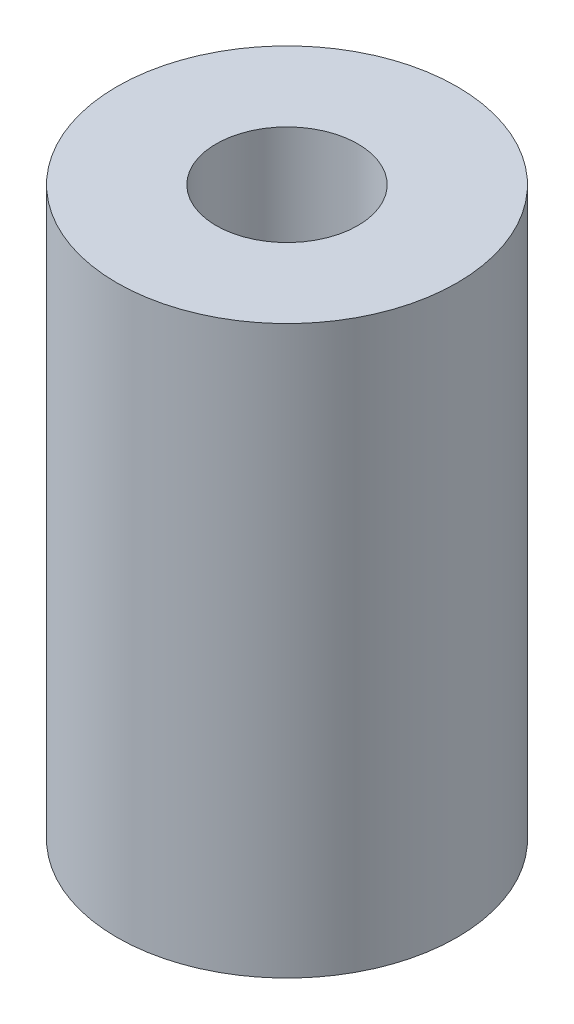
from build123d import *


with BuildPart() as part:
    # Sketch1 → Revolve1 (revolve)
    with BuildSketch(Plane.XY):
        Polygon((3.175, 19.05), (3.175, 0), (4.826, 0), (4.826, -6.35), (7.62, -6.35), (7.62, 19.05), align=None)
    revolve(axis=Axis((0, -161.775441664, 0), (0, 1, 0)))


solid = part.part
